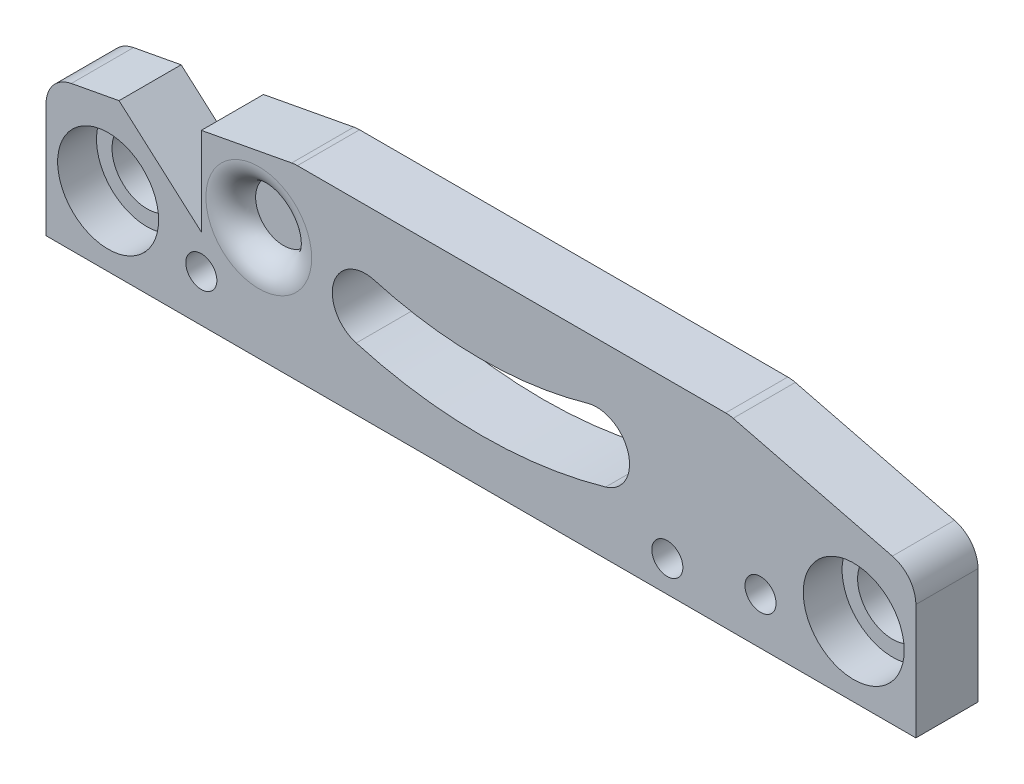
ISO-10303-21;
HEADER;
FILE_DESCRIPTION(('STEP AP214'),'2;1');
FILE_NAME('part.step','',(''),(''),'','','');
FILE_SCHEMA(('AUTOMOTIVE_DESIGN { 1 0 10303 214 1 1 1 1 }'));
ENDSEC;
DATA;
#1=APPLICATION_CONTEXT('core data for automotive mechanical design processes');
#2=APPLICATION_PROTOCOL_DEFINITION('international standard','automotive_design',2000,#1);
#3=PRODUCT_CONTEXT('',#1,'mechanical');
#4=PRODUCT('Part','Part','',(#3));
#5=PRODUCT_RELATED_PRODUCT_CATEGORY('part','',(#4));
#6=PRODUCT_DEFINITION_FORMATION('','',#4);
#7=PRODUCT_DEFINITION_CONTEXT('part definition',#1,'design');
#8=PRODUCT_DEFINITION('design','',#6,#7);
#9=PRODUCT_DEFINITION_SHAPE('','',#8);
#10=(LENGTH_UNIT() NAMED_UNIT(*) SI_UNIT(.MILLI.,.METRE.));
#11=(NAMED_UNIT(*) PLANE_ANGLE_UNIT() SI_UNIT($,.RADIAN.));
#12=(NAMED_UNIT(*) SI_UNIT($,.STERADIAN.) SOLID_ANGLE_UNIT());
#13=UNCERTAINTY_MEASURE_WITH_UNIT(LENGTH_MEASURE(1.E-05),#10,'distance_accuracy_value','');
#14=(GEOMETRIC_REPRESENTATION_CONTEXT(3) GLOBAL_UNCERTAINTY_ASSIGNED_CONTEXT((#13)) GLOBAL_UNIT_ASSIGNED_CONTEXT((#10,
#11,#12)) REPRESENTATION_CONTEXT('',''));
#15=CARTESIAN_POINT('',(0.,0.,0.));
#16=DIRECTION('',(0.,0.,1.));
#17=DIRECTION('',(1.,0.,0.));
#18=AXIS2_PLACEMENT_3D('',#15,#16,#17);
#19=CARTESIAN_POINT('',(-44.45,19.05,0.));
#20=DIRECTION('',(0.,0.,1.));
#21=DIRECTION('',(1.,0.,0.));
#22=AXIS2_PLACEMENT_3D('',#19,#20,#21);
#23=PLANE('',#22);
#24=CARTESIAN_POINT('',(-28.575,4.7625,0.));
#25=DIRECTION('',(0.,0.,1.));
#26=DIRECTION('',(1.,0.,0.));
#27=AXIS2_PLACEMENT_3D('',#24,#25,#26);
#28=CIRCLE('',#27,1.5875);
#29=CARTESIAN_POINT('',(-26.9875,4.7625,0.));
#30=VERTEX_POINT('',#29);
#31=EDGE_CURVE('E512',#30,#30,#28,.T.);
#32=ORIENTED_EDGE('',*,*,#31,.T.);
#33=EDGE_LOOP('',(#32));
#34=FACE_BOUND('',#33,.T.);
#35=CARTESIAN_POINT('',(19.05,3.17500000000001,0.));
#36=DIRECTION('',(0.,0.,1.));
#37=DIRECTION('',(1.,0.,0.));
#38=AXIS2_PLACEMENT_3D('',#35,#36,#37);
#39=CIRCLE('',#38,1.5875);
#40=CARTESIAN_POINT('',(20.6375,3.17500000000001,0.));
#41=VERTEX_POINT('',#40);
#42=EDGE_CURVE('E520',#41,#41,#39,.T.);
#43=ORIENTED_EDGE('',*,*,#42,.T.);
#44=EDGE_LOOP('',(#43));
#45=FACE_BOUND('',#44,.T.);
#46=CARTESIAN_POINT('',(28.575,4.7625,0.));
#47=DIRECTION('',(0.,0.,1.));
#48=DIRECTION('',(1.,0.,0.));
#49=AXIS2_PLACEMENT_3D('',#46,#47,#48);
#50=CIRCLE('',#49,1.5875);
#51=CARTESIAN_POINT('',(30.1625,4.7625,0.));
#52=VERTEX_POINT('',#51);
#53=EDGE_CURVE('E526',#52,#52,#50,.T.);
#54=ORIENTED_EDGE('',*,*,#53,.T.);
#55=EDGE_LOOP('',(#54));
#56=FACE_BOUND('',#55,.T.);
#57=CARTESIAN_POINT('',(-38.1,7.14375,0.));
#58=DIRECTION('',(0.,0.,1.));
#59=DIRECTION('',(1.,0.,0.));
#60=AXIS2_PLACEMENT_3D('',#57,#58,#59);
#61=CIRCLE('',#60,3.57187500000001);
#62=CARTESIAN_POINT('',(-34.528125,7.14375,0.));
#63=VERTEX_POINT('',#62);
#64=EDGE_CURVE('E529',#63,#63,#61,.T.);
#65=ORIENTED_EDGE('',*,*,#64,.T.);
#66=EDGE_LOOP('',(#65));
#67=FACE_BOUND('',#66,.T.);
#68=CARTESIAN_POINT('',(-11.8145061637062,9.59792055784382,0.));
#69=DIRECTION('',(0.,0.,-1.));
#70=DIRECTION('',(-1.,0.,0.));
#71=AXIS2_PLACEMENT_3D('',#68,#69,#70);
#72=CIRCLE('',#71,3.3734375);
#73=CARTESIAN_POINT('',(-12.74435155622,6.35516430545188,0.));
#74=VERTEX_POINT('',#73);
#75=CARTESIAN_POINT('',(-10.8846607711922,12.8406768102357,0.));
#76=VERTEX_POINT('',#75);
#77=EDGE_CURVE('E153',#74,#76,#72,.T.);
#78=ORIENTED_EDGE('',*,*,#77,.F.);
#79=CARTESIAN_POINT('',(0.,50.8,0.));
#80=DIRECTION('',(0.,0.,-1.));
#81=DIRECTION('',(-1.,0.,0.));
#82=AXIS2_PLACEMENT_3D('',#79,#80,#81);
#83=CIRCLE('',#82,46.2359375);
#84=CARTESIAN_POINT('',(12.7443515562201,6.35516430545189,0.));
#85=VERTEX_POINT('',#84);
#86=EDGE_CURVE('E178',#85,#74,#83,.T.);
#87=ORIENTED_EDGE('',*,*,#86,.F.);
#88=CARTESIAN_POINT('',(11.8145061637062,9.59792055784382,0.));
#89=DIRECTION('',(0.,0.,-1.));
#90=DIRECTION('',(-1.,0.,0.));
#91=AXIS2_PLACEMENT_3D('',#88,#89,#90);
#92=CIRCLE('',#91,3.3734375);
#93=CARTESIAN_POINT('',(10.8846607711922,12.8406768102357,0.));
#94=VERTEX_POINT('',#93);
#95=EDGE_CURVE('E176',#94,#85,#92,.T.);
#96=ORIENTED_EDGE('',*,*,#95,.F.);
#97=CARTESIAN_POINT('',(0.,50.8,0.));
#98=DIRECTION('',(0.,0.,1.));
#99=DIRECTION('',(1.,0.,0.));
#100=AXIS2_PLACEMENT_3D('',#97,#98,#99);
#101=CIRCLE('',#100,39.4890625);
#102=EDGE_CURVE('E163',#76,#94,#101,.T.);
#103=ORIENTED_EDGE('',*,*,#102,.F.);
#104=EDGE_LOOP('',(#78,#87,#96,#103));
#105=FACE_BOUND('',#104,.T.);
#106=DIRECTION('',(-0.970142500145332,0.242535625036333,0.));
#107=VECTOR('',#106,1.);
#108=CARTESIAN_POINT('',(44.45,14.2875,0.));
#109=LINE('',#108,#107);
#110=CARTESIAN_POINT('',(42.0450506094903,14.8887373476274,0.));
#111=VERTEX_POINT('',#110);
#112=CARTESIAN_POINT('',(25.7791902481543,18.9552024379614,0.));
#113=VERTEX_POINT('',#112);
#114=EDGE_CURVE('E221',#111,#113,#109,.T.);
#115=ORIENTED_EDGE('',*,*,#114,.F.);
#116=CARTESIAN_POINT('',(41.275,11.808534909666,0.));
#117=DIRECTION('',(0.,0.,1.));
#118=DIRECTION('',(1.,0.,0.));
#119=AXIS2_PLACEMENT_3D('',#116,#117,#118);
#120=CIRCLE('',#119,3.175);
#121=CARTESIAN_POINT('',(44.45,11.808534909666,0.));
#122=VERTEX_POINT('',#121);
#123=EDGE_CURVE('E274',#111,#122,#120,.F.);
#124=ORIENTED_EDGE('',*,*,#123,.T.);
#125=DIRECTION('',(0.,1.,0.));
#126=VECTOR('',#125,1.);
#127=CARTESIAN_POINT('',(44.45,0.,0.));
#128=LINE('',#127,#126);
#129=CARTESIAN_POINT('',(44.45,0.,0.));
#130=VERTEX_POINT('',#129);
#131=EDGE_CURVE('E243',#130,#122,#128,.T.);
#132=ORIENTED_EDGE('',*,*,#131,.F.);
#133=DIRECTION('',(-1.,0.,0.));
#134=VECTOR('',#133,1.);
#135=CARTESIAN_POINT('',(44.45,0.,0.));
#136=LINE('',#135,#134);
#137=CARTESIAN_POINT('',(-44.45,0.,0.));
#138=VERTEX_POINT('',#137);
#139=EDGE_CURVE('E246',#130,#138,#136,.T.);
#140=ORIENTED_EDGE('',*,*,#139,.T.);
#141=DIRECTION('',(0.,1.,0.));
#142=VECTOR('',#141,1.);
#143=CARTESIAN_POINT('',(-44.45,0.,0.));
#144=LINE('',#143,#142);
#145=CARTESIAN_POINT('',(-44.45,11.6524840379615,0.));
#146=VERTEX_POINT('',#145);
#147=EDGE_CURVE('E231',#138,#146,#144,.T.);
#148=ORIENTED_EDGE('',*,*,#147,.T.);
#149=CARTESIAN_POINT('',(-41.275,11.6524840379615,0.));
#150=DIRECTION('',(0.,0.,1.));
#151=DIRECTION('',(1.,0.,0.));
#152=AXIS2_PLACEMENT_3D('',#149,#150,#151);
#153=CIRCLE('',#152,3.175);
#154=CARTESIAN_POINT('',(-41.8601160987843,14.7731032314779,0.));
#155=VERTEX_POINT('',#154);
#156=EDGE_CURVE('E47',#146,#155,#153,.F.);
#157=ORIENTED_EDGE('',*,*,#156,.T.);
#158=DIRECTION('',(-0.982872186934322,-0.184288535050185,0.));
#159=VECTOR('',#158,1.);
#160=CARTESIAN_POINT('',(-43.587358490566,14.4492452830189,0.));
#161=LINE('',#160,#159);
#162=CARTESIAN_POINT('',(-36.9843867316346,15.6873024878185,0.));
#163=VERTEX_POINT('',#162);
#164=EDGE_CURVE('E217',#163,#155,#161,.T.);
#165=ORIENTED_EDGE('',*,*,#164,.F.);
#166=DIRECTION('',(0.749616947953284,-0.661871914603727,0.));
#167=VECTOR('',#166,1.);
#168=CARTESIAN_POINT('',(-36.9843867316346,15.6873024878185,0.));
#169=LINE('',#168,#167);
#170=CARTESIAN_POINT('',(-28.575,8.26226105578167,0.));
#171=VERTEX_POINT('',#170);
#172=EDGE_CURVE('E199',#163,#171,#169,.T.);
#173=ORIENTED_EDGE('',*,*,#172,.T.);
#174=DIRECTION('',(0.,1.,0.));
#175=VECTOR('',#174,1.);
#176=CARTESIAN_POINT('',(-28.575,8.26226105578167,0.));
#177=LINE('',#176,#175);
#178=CARTESIAN_POINT('',(-28.575,17.2640625,0.));
#179=VERTEX_POINT('',#178);
#180=EDGE_CURVE('E196',#171,#179,#177,.T.);
#181=ORIENTED_EDGE('',*,*,#180,.T.);
#182=CARTESIAN_POINT('',(-19.3400309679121,18.9956191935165,0.));
#183=VERTEX_POINT('',#182);
#184=EDGE_CURVE('E218',#183,#179,#161,.T.);
#185=ORIENTED_EDGE('',*,*,#184,.F.);
#186=CARTESIAN_POINT('',(-18.7549148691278,15.875,0.));
#187=DIRECTION('',(0.,0.,1.));
#188=DIRECTION('',(1.,0.,0.));
#189=AXIS2_PLACEMENT_3D('',#186,#187,#188);
#190=CIRCLE('',#189,3.175);
#191=CARTESIAN_POINT('',(-18.7549148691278,19.05,0.));
#192=VERTEX_POINT('',#191);
#193=EDGE_CURVE('E271',#183,#192,#190,.F.);
#194=ORIENTED_EDGE('',*,*,#193,.T.);
#195=DIRECTION('',(1.,0.,0.));
#196=VECTOR('',#195,1.);
#197=CARTESIAN_POINT('',(-44.45,19.05,0.));
#198=LINE('',#197,#196);
#199=CARTESIAN_POINT('',(25.0091396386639,19.05,0.));
#200=VERTEX_POINT('',#199);
#201=EDGE_CURVE('E224',#192,#200,#198,.T.);
#202=ORIENTED_EDGE('',*,*,#201,.T.);
#203=CARTESIAN_POINT('',(25.0091396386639,15.875,0.));
#204=DIRECTION('',(0.,0.,1.));
#205=DIRECTION('',(1.,0.,0.));
#206=AXIS2_PLACEMENT_3D('',#203,#204,#205);
#207=CIRCLE('',#206,3.175);
#208=EDGE_CURVE('E269',#200,#113,#207,.F.);
#209=ORIENTED_EDGE('',*,*,#208,.T.);
#210=EDGE_LOOP('',(#115,#124,#132,#140,#148,#157,#165,#173,#181,#185,#194,#202,#209));
#211=FACE_BOUND('',#210,.T.);
#212=CARTESIAN_POINT('',(38.1,7.14375,0.));
#213=DIRECTION('',(0.,0.,1.));
#214=DIRECTION('',(1.,0.,0.));
#215=AXIS2_PLACEMENT_3D('',#212,#213,#214);
#216=CIRCLE('',#215,3.57187500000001);
#217=CARTESIAN_POINT('',(41.671875,7.14375,0.));
#218=VERTEX_POINT('',#217);
#219=EDGE_CURVE('E543',#218,#218,#216,.T.);
#220=ORIENTED_EDGE('',*,*,#219,.T.);
#221=EDGE_LOOP('',(#220));
#222=FACE_BOUND('',#221,.T.);
#223=ADVANCED_FACE('F32',(#34,#45,#56,#67,#105,#211,#222),#23,.F.);
#224=CARTESIAN_POINT('',(-44.45,19.05,6.35));
#225=DIRECTION('',(0.,0.,1.));
#226=DIRECTION('',(1.,0.,0.));
#227=AXIS2_PLACEMENT_3D('',#224,#225,#226);
#228=PLANE('',#227);
#229=CARTESIAN_POINT('',(-22.7049600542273,11.5847327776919,6.35));
#230=DIRECTION('',(0.,0.,1.));
#231=DIRECTION('',(1.,0.,0.));
#232=AXIS2_PLACEMENT_3D('',#229,#230,#231);
#233=CIRCLE('',#232,5.40317996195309);
#234=CARTESIAN_POINT('',(-17.3017800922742,11.5847327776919,6.35));
#235=VERTEX_POINT('',#234);
#236=EDGE_CURVE('E11',#235,#235,#233,.F.);
#237=ORIENTED_EDGE('',*,*,#236,.T.);
#238=EDGE_LOOP('',(#237));
#239=FACE_BOUND('',#238,.T.);
#240=CARTESIAN_POINT('',(-28.575,4.7625,6.35));
#241=DIRECTION('',(0.,0.,1.));
#242=DIRECTION('',(1.,0.,0.));
#243=AXIS2_PLACEMENT_3D('',#240,#241,#242);
#244=CIRCLE('',#243,1.5875);
#245=CARTESIAN_POINT('',(-26.9875,4.7625,6.35));
#246=VERTEX_POINT('',#245);
#247=EDGE_CURVE('E514',#246,#246,#244,.T.);
#248=ORIENTED_EDGE('',*,*,#247,.F.);
#249=EDGE_LOOP('',(#248));
#250=FACE_BOUND('',#249,.T.);
#251=CARTESIAN_POINT('',(19.05,3.17500000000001,6.34999999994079));
#252=DIRECTION('',(0.,0.,1.));
#253=DIRECTION('',(1.,0.,0.));
#254=AXIS2_PLACEMENT_3D('',#251,#252,#253);
#255=CIRCLE('',#254,1.5875);
#256=CARTESIAN_POINT('',(20.6375,3.17500000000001,6.34999999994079));
#257=VERTEX_POINT('',#256);
#258=EDGE_CURVE('E519',#257,#257,#255,.T.);
#259=ORIENTED_EDGE('',*,*,#258,.F.);
#260=EDGE_LOOP('',(#259));
#261=FACE_BOUND('',#260,.T.);
#262=CARTESIAN_POINT('',(28.575,4.7625,6.35));
#263=DIRECTION('',(0.,0.,1.));
#264=DIRECTION('',(1.,0.,0.));
#265=AXIS2_PLACEMENT_3D('',#262,#263,#264);
#266=CIRCLE('',#265,1.5875);
#267=CARTESIAN_POINT('',(30.1625,4.7625,6.35));
#268=VERTEX_POINT('',#267);
#269=EDGE_CURVE('E523',#268,#268,#266,.T.);
#270=ORIENTED_EDGE('',*,*,#269,.F.);
#271=EDGE_LOOP('',(#270));
#272=FACE_BOUND('',#271,.T.);
#273=CARTESIAN_POINT('',(-38.1,7.14375,6.35));
#274=DIRECTION('',(0.,0.,1.));
#275=DIRECTION('',(1.,0.,0.));
#276=AXIS2_PLACEMENT_3D('',#273,#274,#275);
#277=CIRCLE('',#276,5.15937499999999);
#278=CARTESIAN_POINT('',(-32.940625,7.14375,6.35));
#279=VERTEX_POINT('',#278);
#280=EDGE_CURVE('E540',#279,#279,#277,.T.);
#281=ORIENTED_EDGE('',*,*,#280,.F.);
#282=EDGE_LOOP('',(#281));
#283=FACE_BOUND('',#282,.T.);
#284=CARTESIAN_POINT('',(0.,50.8,6.35));
#285=DIRECTION('',(0.,0.,-1.));
#286=DIRECTION('',(-1.,0.,0.));
#287=AXIS2_PLACEMENT_3D('',#284,#285,#286);
#288=CIRCLE('',#287,46.2359375);
#289=CARTESIAN_POINT('',(12.7443515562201,6.35516430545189,6.35));
#290=VERTEX_POINT('',#289);
#291=CARTESIAN_POINT('',(-12.74435155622,6.35516430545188,6.35));
#292=VERTEX_POINT('',#291);
#293=EDGE_CURVE('E164',#290,#292,#288,.T.);
#294=ORIENTED_EDGE('',*,*,#293,.T.);
#295=CARTESIAN_POINT('',(-11.8145061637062,9.59792055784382,6.35));
#296=DIRECTION('',(0.,0.,-1.));
#297=DIRECTION('',(-1.,0.,0.));
#298=AXIS2_PLACEMENT_3D('',#295,#296,#297);
#299=CIRCLE('',#298,3.3734375);
#300=CARTESIAN_POINT('',(-10.8846607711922,12.8406768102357,6.35));
#301=VERTEX_POINT('',#300);
#302=EDGE_CURVE('E183',#292,#301,#299,.T.);
#303=ORIENTED_EDGE('',*,*,#302,.T.);
#304=CARTESIAN_POINT('',(0.,50.8,6.35));
#305=DIRECTION('',(0.,0.,1.));
#306=DIRECTION('',(1.,0.,0.));
#307=AXIS2_PLACEMENT_3D('',#304,#305,#306);
#308=CIRCLE('',#307,39.4890625);
#309=CARTESIAN_POINT('',(10.8846607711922,12.8406768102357,6.35));
#310=VERTEX_POINT('',#309);
#311=EDGE_CURVE('E170',#301,#310,#308,.T.);
#312=ORIENTED_EDGE('',*,*,#311,.T.);
#313=CARTESIAN_POINT('',(11.8145061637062,9.59792055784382,6.35));
#314=DIRECTION('',(0.,0.,-1.));
#315=DIRECTION('',(-1.,0.,0.));
#316=AXIS2_PLACEMENT_3D('',#313,#314,#315);
#317=CIRCLE('',#316,3.3734375);
#318=EDGE_CURVE('E187',#310,#290,#317,.T.);
#319=ORIENTED_EDGE('',*,*,#318,.T.);
#320=EDGE_LOOP('',(#294,#303,#312,#319));
#321=FACE_BOUND('',#320,.T.);
#322=DIRECTION('',(0.,1.,0.));
#323=VECTOR('',#322,1.);
#324=CARTESIAN_POINT('',(44.45,0.,6.35));
#325=LINE('',#324,#323);
#326=CARTESIAN_POINT('',(44.45,0.,6.35));
#327=VERTEX_POINT('',#326);
#328=CARTESIAN_POINT('',(44.45,11.808534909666,6.35));
#329=VERTEX_POINT('',#328);
#330=EDGE_CURVE('E230',#327,#329,#325,.T.);
#331=ORIENTED_EDGE('',*,*,#330,.T.);
#332=CARTESIAN_POINT('',(41.275,11.808534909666,6.35));
#333=DIRECTION('',(0.,0.,1.));
#334=DIRECTION('',(1.,0.,0.));
#335=AXIS2_PLACEMENT_3D('',#332,#333,#334);
#336=CIRCLE('',#335,3.175);
#337=CARTESIAN_POINT('',(42.0450506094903,14.8887373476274,6.35));
#338=VERTEX_POINT('',#337);
#339=EDGE_CURVE('E262',#329,#338,#336,.T.);
#340=ORIENTED_EDGE('',*,*,#339,.T.);
#341=DIRECTION('',(-0.970142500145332,0.242535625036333,0.));
#342=VECTOR('',#341,1.);
#343=CARTESIAN_POINT('',(44.45,14.2875,6.35));
#344=LINE('',#343,#342);
#345=CARTESIAN_POINT('',(25.7791902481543,18.9552024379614,6.35));
#346=VERTEX_POINT('',#345);
#347=EDGE_CURVE('E220',#338,#346,#344,.T.);
#348=ORIENTED_EDGE('',*,*,#347,.T.);
#349=CARTESIAN_POINT('',(25.0091396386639,15.875,6.35));
#350=DIRECTION('',(0.,0.,1.));
#351=DIRECTION('',(1.,0.,0.));
#352=AXIS2_PLACEMENT_3D('',#349,#350,#351);
#353=CIRCLE('',#352,3.175);
#354=CARTESIAN_POINT('',(25.0091396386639,19.05,6.35));
#355=VERTEX_POINT('',#354);
#356=EDGE_CURVE('E256',#346,#355,#353,.T.);
#357=ORIENTED_EDGE('',*,*,#356,.T.);
#358=DIRECTION('',(1.,0.,0.));
#359=VECTOR('',#358,1.);
#360=CARTESIAN_POINT('',(-44.45,19.05,6.35));
#361=LINE('',#360,#359);
#362=CARTESIAN_POINT('',(-18.7549148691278,19.05,6.35));
#363=VERTEX_POINT('',#362);
#364=EDGE_CURVE('E227',#363,#355,#361,.T.);
#365=ORIENTED_EDGE('',*,*,#364,.F.);
#366=CARTESIAN_POINT('',(-18.7549148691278,15.875,6.35));
#367=DIRECTION('',(0.,0.,1.));
#368=DIRECTION('',(1.,0.,0.));
#369=AXIS2_PLACEMENT_3D('',#366,#367,#368);
#370=CIRCLE('',#369,3.175);
#371=CARTESIAN_POINT('',(-19.3400309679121,18.9956191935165,6.35));
#372=VERTEX_POINT('',#371);
#373=EDGE_CURVE('E258',#363,#372,#370,.T.);
#374=ORIENTED_EDGE('',*,*,#373,.T.);
#375=DIRECTION('',(0.982872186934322,0.184288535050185,0.));
#376=VECTOR('',#375,1.);
#377=CARTESIAN_POINT('',(-44.45,14.2875,6.35));
#378=LINE('',#377,#376);
#379=CARTESIAN_POINT('',(-28.575,17.2640625,6.35));
#380=VERTEX_POINT('',#379);
#381=EDGE_CURVE('E214',#380,#372,#378,.T.);
#382=ORIENTED_EDGE('',*,*,#381,.F.);
#383=DIRECTION('',(0.,1.,0.));
#384=VECTOR('',#383,1.);
#385=CARTESIAN_POINT('',(-28.575,8.26226105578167,6.35));
#386=LINE('',#385,#384);
#387=CARTESIAN_POINT('',(-28.575,8.26226105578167,6.35));
#388=VERTEX_POINT('',#387);
#389=EDGE_CURVE('E171',#388,#380,#386,.T.);
#390=ORIENTED_EDGE('',*,*,#389,.F.);
#391=DIRECTION('',(0.749616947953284,-0.661871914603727,0.));
#392=VECTOR('',#391,1.);
#393=CARTESIAN_POINT('',(-36.9843867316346,15.6873024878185,6.35));
#394=LINE('',#393,#392);
#395=CARTESIAN_POINT('',(-36.9843867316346,15.6873024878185,6.35));
#396=VERTEX_POINT('',#395);
#397=EDGE_CURVE('E200',#396,#388,#394,.T.);
#398=ORIENTED_EDGE('',*,*,#397,.F.);
#399=CARTESIAN_POINT('',(-41.8601160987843,14.7731032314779,6.35));
#400=VERTEX_POINT('',#399);
#401=EDGE_CURVE('E215',#400,#396,#378,.T.);
#402=ORIENTED_EDGE('',*,*,#401,.F.);
#403=CARTESIAN_POINT('',(-41.275,11.6524840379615,6.35));
#404=DIRECTION('',(0.,0.,1.));
#405=DIRECTION('',(1.,0.,0.));
#406=AXIS2_PLACEMENT_3D('',#403,#404,#405);
#407=CIRCLE('',#406,3.175);
#408=CARTESIAN_POINT('',(-44.45,11.6524840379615,6.35));
#409=VERTEX_POINT('',#408);
#410=EDGE_CURVE('E260',#400,#409,#407,.T.);
#411=ORIENTED_EDGE('',*,*,#410,.T.);
#412=DIRECTION('',(0.,1.,0.));
#413=VECTOR('',#412,1.);
#414=CARTESIAN_POINT('',(-44.45,0.,6.35));
#415=LINE('',#414,#413);
#416=CARTESIAN_POINT('',(-44.45,0.,6.35));
#417=VERTEX_POINT('',#416);
#418=EDGE_CURVE('E237',#417,#409,#415,.T.);
#419=ORIENTED_EDGE('',*,*,#418,.F.);
#420=DIRECTION('',(-1.,0.,0.));
#421=VECTOR('',#420,1.);
#422=CARTESIAN_POINT('',(44.45,0.,6.35));
#423=LINE('',#422,#421);
#424=EDGE_CURVE('E234',#327,#417,#423,.T.);
#425=ORIENTED_EDGE('',*,*,#424,.F.);
#426=EDGE_LOOP('',(#331,#340,#348,#357,#365,#374,#382,#390,#398,#402,#411,#419,#425));
#427=FACE_BOUND('',#426,.T.);
#428=CARTESIAN_POINT('',(38.1,7.14375,6.35));
#429=DIRECTION('',(0.,0.,1.));
#430=DIRECTION('',(1.,0.,0.));
#431=AXIS2_PLACEMENT_3D('',#428,#429,#430);
#432=CIRCLE('',#431,5.15937499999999);
#433=CARTESIAN_POINT('',(43.259375,7.14375,6.35));
#434=VERTEX_POINT('',#433);
#435=EDGE_CURVE('E185',#434,#434,#432,.T.);
#436=ORIENTED_EDGE('',*,*,#435,.F.);
#437=EDGE_LOOP('',(#436));
#438=FACE_BOUND('',#437,.T.);
#439=ADVANCED_FACE('F293',(#239,#250,#261,#272,#283,#321,#427,#438),#228,.T.);
#440=CARTESIAN_POINT('',(-44.45,14.2875,6.35));
#441=DIRECTION('',(-0.184288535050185,0.982872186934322,0.));
#442=DIRECTION('',(-0.982872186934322,-0.184288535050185,0.));
#443=AXIS2_PLACEMENT_3D('',#440,#441,#442);
#444=PLANE('',#443);
#445=ORIENTED_EDGE('',*,*,#381,.T.);
#446=DIRECTION('',(0.,0.,-1.));
#447=VECTOR('',#446,1.);
#448=CARTESIAN_POINT('',(-19.3400309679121,18.9956191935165,6.35));
#449=LINE('',#448,#447);
#450=EDGE_CURVE('E280',#372,#183,#449,.T.);
#451=ORIENTED_EDGE('',*,*,#450,.T.);
#452=ORIENTED_EDGE('',*,*,#184,.T.);
#453=DIRECTION('',(0.,0.,1.));
#454=VECTOR('',#453,1.);
#455=CARTESIAN_POINT('',(-28.575,17.2640625,0.));
#456=LINE('',#455,#454);
#457=EDGE_CURVE('E211',#179,#380,#456,.T.);
#458=ORIENTED_EDGE('',*,*,#457,.T.);
#459=EDGE_LOOP('',(#445,#451,#452,#458));
#460=FACE_BOUND('',#459,.T.);
#461=ADVANCED_FACE('F301',(#460),#444,.T.);
#462=CARTESIAN_POINT('',(-44.45,19.05,6.35));
#463=DIRECTION('',(0.,1.,0.));
#464=DIRECTION('',(-1.,0.,0.));
#465=AXIS2_PLACEMENT_3D('',#462,#463,#464);
#466=PLANE('',#465);
#467=ORIENTED_EDGE('',*,*,#201,.F.);
#468=DIRECTION('',(0.,0.,-1.));
#469=VECTOR('',#468,1.);
#470=CARTESIAN_POINT('',(-18.7549148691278,19.05,6.35));
#471=LINE('',#470,#469);
#472=EDGE_CURVE('E40',#192,#363,#471,.F.);
#473=ORIENTED_EDGE('',*,*,#472,.T.);
#474=ORIENTED_EDGE('',*,*,#364,.T.);
#475=DIRECTION('',(0.,0.,1.));
#476=VECTOR('',#475,1.);
#477=CARTESIAN_POINT('',(25.0091396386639,19.05,6.35));
#478=LINE('',#477,#476);
#479=EDGE_CURVE('E283',#355,#200,#478,.F.);
#480=ORIENTED_EDGE('',*,*,#479,.T.);
#481=EDGE_LOOP('',(#467,#473,#474,#480));
#482=FACE_BOUND('',#481,.T.);
#483=ADVANCED_FACE('F288',(#482),#466,.T.);
#484=CARTESIAN_POINT('',(-44.45,0.,6.35));
#485=DIRECTION('',(-1.,0.,0.));
#486=DIRECTION('',(0.,-1.,0.));
#487=AXIS2_PLACEMENT_3D('',#484,#485,#486);
#488=PLANE('',#487);
#489=ORIENTED_EDGE('',*,*,#418,.T.);
#490=DIRECTION('',(0.,0.,-1.));
#491=VECTOR('',#490,1.);
#492=CARTESIAN_POINT('',(-44.45,11.6524840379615,6.35));
#493=LINE('',#492,#491);
#494=EDGE_CURVE('E276',#409,#146,#493,.T.);
#495=ORIENTED_EDGE('',*,*,#494,.T.);
#496=ORIENTED_EDGE('',*,*,#147,.F.);
#497=DIRECTION('',(0.,0.,-1.));
#498=VECTOR('',#497,1.);
#499=CARTESIAN_POINT('',(-44.45,0.,6.35));
#500=LINE('',#499,#498);
#501=EDGE_CURVE('E250',#417,#138,#500,.T.);
#502=ORIENTED_EDGE('',*,*,#501,.F.);
#503=EDGE_LOOP('',(#489,#495,#496,#502));
#504=FACE_BOUND('',#503,.T.);
#505=ADVANCED_FACE('F321',(#504),#488,.T.);
#506=CARTESIAN_POINT('',(44.45,0.,6.35));
#507=DIRECTION('',(-1.,0.,0.));
#508=DIRECTION('',(0.,-1.,0.));
#509=AXIS2_PLACEMENT_3D('',#506,#507,#508);
#510=PLANE('',#509);
#511=ORIENTED_EDGE('',*,*,#131,.T.);
#512=DIRECTION('',(0.,0.,1.));
#513=VECTOR('',#512,1.);
#514=CARTESIAN_POINT('',(44.45,11.808534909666,6.35));
#515=LINE('',#514,#513);
#516=EDGE_CURVE('E252',#122,#329,#515,.T.);
#517=ORIENTED_EDGE('',*,*,#516,.T.);
#518=ORIENTED_EDGE('',*,*,#330,.F.);
#519=DIRECTION('',(0.,0.,-1.));
#520=VECTOR('',#519,1.);
#521=CARTESIAN_POINT('',(44.45,0.,6.35));
#522=LINE('',#521,#520);
#523=EDGE_CURVE('E240',#327,#130,#522,.T.);
#524=ORIENTED_EDGE('',*,*,#523,.T.);
#525=EDGE_LOOP('',(#511,#517,#518,#524));
#526=FACE_BOUND('',#525,.T.);
#527=ADVANCED_FACE('F329',(#526),#510,.F.);
#528=CARTESIAN_POINT('',(44.45,0.,6.35));
#529=DIRECTION('',(0.,-1.,0.));
#530=DIRECTION('',(1.,0.,0.));
#531=AXIS2_PLACEMENT_3D('',#528,#529,#530);
#532=PLANE('',#531);
#533=ORIENTED_EDGE('',*,*,#139,.F.);
#534=ORIENTED_EDGE('',*,*,#523,.F.);
#535=ORIENTED_EDGE('',*,*,#424,.T.);
#536=ORIENTED_EDGE('',*,*,#501,.T.);
#537=EDGE_LOOP('',(#533,#534,#535,#536));
#538=FACE_BOUND('',#537,.T.);
#539=ADVANCED_FACE('F325',(#538),#532,.T.);
#540=CARTESIAN_POINT('',(44.45,14.2875,0.));
#541=DIRECTION('',(0.242535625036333,0.970142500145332,0.));
#542=DIRECTION('',(-0.970142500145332,0.242535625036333,0.));
#543=AXIS2_PLACEMENT_3D('',#540,#541,#542);
#544=PLANE('',#543);
#545=ORIENTED_EDGE('',*,*,#347,.F.);
#546=DIRECTION('',(0.,0.,1.));
#547=VECTOR('',#546,1.);
#548=CARTESIAN_POINT('',(42.0450506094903,14.8887373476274,0.));
#549=LINE('',#548,#547);
#550=EDGE_CURVE('E267',#338,#111,#549,.F.);
#551=ORIENTED_EDGE('',*,*,#550,.T.);
#552=ORIENTED_EDGE('',*,*,#114,.T.);
#553=DIRECTION('',(0.,0.,1.));
#554=VECTOR('',#553,1.);
#555=CARTESIAN_POINT('',(25.7791902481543,18.9552024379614,0.));
#556=LINE('',#555,#554);
#557=EDGE_CURVE('E264',#113,#346,#556,.T.);
#558=ORIENTED_EDGE('',*,*,#557,.T.);
#559=EDGE_LOOP('',(#545,#551,#552,#558));
#560=FACE_BOUND('',#559,.T.);
#561=ADVANCED_FACE('F337',(#560),#544,.T.);
#562=ORIENTED_EDGE('',*,*,#164,.T.);
#563=DIRECTION('',(0.,0.,-1.));
#564=VECTOR('',#563,1.);
#565=CARTESIAN_POINT('',(-41.8601160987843,14.7731032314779,6.35));
#566=LINE('',#565,#564);
#567=EDGE_CURVE('E278',#155,#400,#566,.F.);
#568=ORIENTED_EDGE('',*,*,#567,.T.);
#569=ORIENTED_EDGE('',*,*,#401,.T.);
#570=DIRECTION('',(0.,0.,1.));
#571=VECTOR('',#570,1.);
#572=CARTESIAN_POINT('',(-36.9843867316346,15.6873024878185,0.));
#573=LINE('',#572,#571);
#574=EDGE_CURVE('E203',#163,#396,#573,.T.);
#575=ORIENTED_EDGE('',*,*,#574,.F.);
#576=EDGE_LOOP('',(#562,#568,#569,#575));
#577=FACE_BOUND('',#576,.T.);
#578=ADVANCED_FACE('F316',(#577),#444,.T.);
#579=CARTESIAN_POINT('',(-28.575,8.26226105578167,0.));
#580=DIRECTION('',(1.,0.,0.));
#581=DIRECTION('',(0.,0.,-1.));
#582=AXIS2_PLACEMENT_3D('',#579,#580,#581);
#583=PLANE('',#582);
#584=ORIENTED_EDGE('',*,*,#389,.T.);
#585=ORIENTED_EDGE('',*,*,#457,.F.);
#586=ORIENTED_EDGE('',*,*,#180,.F.);
#587=DIRECTION('',(0.,0.,1.));
#588=VECTOR('',#587,1.);
#589=CARTESIAN_POINT('',(-28.575,8.26226105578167,0.));
#590=LINE('',#589,#588);
#591=EDGE_CURVE('E209',#171,#388,#590,.T.);
#592=ORIENTED_EDGE('',*,*,#591,.T.);
#593=EDGE_LOOP('',(#584,#585,#586,#592));
#594=FACE_BOUND('',#593,.T.);
#595=ADVANCED_FACE('F307',(#594),#583,.F.);
#596=CARTESIAN_POINT('',(-36.9843867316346,15.6873024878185,0.));
#597=DIRECTION('',(-0.661871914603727,-0.749616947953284,0.));
#598=DIRECTION('',(0.749616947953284,-0.661871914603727,0.));
#599=AXIS2_PLACEMENT_3D('',#596,#597,#598);
#600=PLANE('',#599);
#601=ORIENTED_EDGE('',*,*,#397,.T.);
#602=ORIENTED_EDGE('',*,*,#591,.F.);
#603=ORIENTED_EDGE('',*,*,#172,.F.);
#604=ORIENTED_EDGE('',*,*,#574,.T.);
#605=EDGE_LOOP('',(#601,#602,#603,#604));
#606=FACE_BOUND('',#605,.T.);
#607=ADVANCED_FACE('F313',(#606),#600,.F.);
#608=CARTESIAN_POINT('',(-11.8145061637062,9.59792055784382,0.));
#609=DIRECTION('',(0.,0.,1.));
#610=DIRECTION('',(1.,0.,0.));
#611=AXIS2_PLACEMENT_3D('',#608,#609,#610);
#612=CYLINDRICAL_SURFACE('',#611,3.3734375);
#613=ORIENTED_EDGE('',*,*,#302,.F.);
#614=DIRECTION('',(0.,0.,1.));
#615=VECTOR('',#614,1.);
#616=CARTESIAN_POINT('',(-12.74435155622,6.35516430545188,0.));
#617=LINE('',#616,#615);
#618=EDGE_CURVE('E159',#74,#292,#617,.T.);
#619=ORIENTED_EDGE('',*,*,#618,.F.);
#620=ORIENTED_EDGE('',*,*,#77,.T.);
#621=DIRECTION('',(0.,0.,1.));
#622=VECTOR('',#621,1.);
#623=CARTESIAN_POINT('',(-10.8846607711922,12.8406768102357,0.));
#624=LINE('',#623,#622);
#625=EDGE_CURVE('E156',#76,#301,#624,.T.);
#626=ORIENTED_EDGE('',*,*,#625,.T.);
#627=EDGE_LOOP('',(#613,#619,#620,#626));
#628=FACE_BOUND('',#627,.T.);
#629=ADVANCED_FACE('F155',(#628),#612,.F.);
#630=CARTESIAN_POINT('',(0.,50.8,0.));
#631=DIRECTION('',(0.,0.,1.));
#632=DIRECTION('',(1.,0.,0.));
#633=AXIS2_PLACEMENT_3D('',#630,#631,#632);
#634=CYLINDRICAL_SURFACE('',#633,39.4890625);
#635=ORIENTED_EDGE('',*,*,#311,.F.);
#636=ORIENTED_EDGE('',*,*,#625,.F.);
#637=ORIENTED_EDGE('',*,*,#102,.T.);
#638=DIRECTION('',(0.,0.,1.));
#639=VECTOR('',#638,1.);
#640=CARTESIAN_POINT('',(10.8846607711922,12.8406768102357,0.));
#641=LINE('',#640,#639);
#642=EDGE_CURVE('E172',#94,#310,#641,.T.);
#643=ORIENTED_EDGE('',*,*,#642,.T.);
#644=EDGE_LOOP('',(#635,#636,#637,#643));
#645=FACE_BOUND('',#644,.T.);
#646=ADVANCED_FACE('F167',(#645),#634,.T.);
#647=CARTESIAN_POINT('',(11.8145061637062,9.59792055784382,0.));
#648=DIRECTION('',(0.,0.,1.));
#649=DIRECTION('',(1.,0.,0.));
#650=AXIS2_PLACEMENT_3D('',#647,#648,#649);
#651=CYLINDRICAL_SURFACE('',#650,3.3734375);
#652=ORIENTED_EDGE('',*,*,#318,.F.);
#653=ORIENTED_EDGE('',*,*,#642,.F.);
#654=ORIENTED_EDGE('',*,*,#95,.T.);
#655=DIRECTION('',(0.,0.,1.));
#656=VECTOR('',#655,1.);
#657=CARTESIAN_POINT('',(12.7443515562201,6.35516430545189,0.));
#658=LINE('',#657,#656);
#659=EDGE_CURVE('E193',#85,#290,#658,.T.);
#660=ORIENTED_EDGE('',*,*,#659,.T.);
#661=EDGE_LOOP('',(#652,#653,#654,#660));
#662=FACE_BOUND('',#661,.T.);
#663=ADVANCED_FACE('F567',(#662),#651,.F.);
#664=CARTESIAN_POINT('',(0.,50.8,0.));
#665=DIRECTION('',(0.,0.,1.));
#666=DIRECTION('',(1.,0.,0.));
#667=AXIS2_PLACEMENT_3D('',#664,#665,#666);
#668=CYLINDRICAL_SURFACE('',#667,46.2359375);
#669=ORIENTED_EDGE('',*,*,#293,.F.);
#670=ORIENTED_EDGE('',*,*,#659,.F.);
#671=ORIENTED_EDGE('',*,*,#86,.T.);
#672=ORIENTED_EDGE('',*,*,#618,.T.);
#673=EDGE_LOOP('',(#669,#670,#671,#672));
#674=FACE_BOUND('',#673,.T.);
#675=ADVANCED_FACE('F374',(#674),#668,.F.);
#676=CARTESIAN_POINT('',(41.275,11.808534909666,6.35));
#677=DIRECTION('',(0.,0.,-1.));
#678=DIRECTION('',(-1.,0.,0.));
#679=AXIS2_PLACEMENT_3D('',#676,#677,#678);
#680=CYLINDRICAL_SURFACE('',#679,3.175);
#681=ORIENTED_EDGE('',*,*,#123,.F.);
#682=ORIENTED_EDGE('',*,*,#550,.F.);
#683=ORIENTED_EDGE('',*,*,#339,.F.);
#684=ORIENTED_EDGE('',*,*,#516,.F.);
#685=EDGE_LOOP('',(#681,#682,#683,#684));
#686=FACE_BOUND('',#685,.T.);
#687=ADVANCED_FACE('F334',(#686),#680,.T.);
#688=CARTESIAN_POINT('',(-41.275,11.6524840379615,6.35));
#689=DIRECTION('',(0.,0.,-1.));
#690=DIRECTION('',(-1.,0.,0.));
#691=AXIS2_PLACEMENT_3D('',#688,#689,#690);
#692=CYLINDRICAL_SURFACE('',#691,3.175);
#693=ORIENTED_EDGE('',*,*,#410,.F.);
#694=ORIENTED_EDGE('',*,*,#567,.F.);
#695=ORIENTED_EDGE('',*,*,#156,.F.);
#696=ORIENTED_EDGE('',*,*,#494,.F.);
#697=EDGE_LOOP('',(#693,#694,#695,#696));
#698=FACE_BOUND('',#697,.T.);
#699=ADVANCED_FACE('F317',(#698),#692,.T.);
#700=CARTESIAN_POINT('',(-18.7549148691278,15.875,6.35));
#701=DIRECTION('',(0.,0.,-1.));
#702=DIRECTION('',(-1.,0.,0.));
#703=AXIS2_PLACEMENT_3D('',#700,#701,#702);
#704=CYLINDRICAL_SURFACE('',#703,3.175);
#705=ORIENTED_EDGE('',*,*,#373,.F.);
#706=ORIENTED_EDGE('',*,*,#472,.F.);
#707=ORIENTED_EDGE('',*,*,#193,.F.);
#708=ORIENTED_EDGE('',*,*,#450,.F.);
#709=EDGE_LOOP('',(#705,#706,#707,#708));
#710=FACE_BOUND('',#709,.T.);
#711=ADVANCED_FACE('F298',(#710),#704,.T.);
#712=CARTESIAN_POINT('',(25.0091396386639,15.875,0.));
#713=DIRECTION('',(0.,0.,1.));
#714=DIRECTION('',(1.,0.,0.));
#715=AXIS2_PLACEMENT_3D('',#712,#713,#714);
#716=CYLINDRICAL_SURFACE('',#715,3.175);
#717=ORIENTED_EDGE('',*,*,#208,.F.);
#718=ORIENTED_EDGE('',*,*,#479,.F.);
#719=ORIENTED_EDGE('',*,*,#356,.F.);
#720=ORIENTED_EDGE('',*,*,#557,.F.);
#721=EDGE_LOOP('',(#717,#718,#719,#720));
#722=FACE_BOUND('',#721,.T.);
#723=ADVANCED_FACE('F341',(#722),#716,.T.);
#724=CARTESIAN_POINT('',(38.1,7.14375,6.35));
#725=DIRECTION('',(0.,0.,1.));
#726=DIRECTION('',(1.,0.,0.));
#727=AXIS2_PLACEMENT_3D('',#724,#725,#726);
#728=CYLINDRICAL_SURFACE('',#727,5.15937499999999);
#729=ORIENTED_EDGE('',*,*,#435,.T.);
#730=EDGE_LOOP('',(#729));
#731=FACE_BOUND('',#730,.T.);
#732=CARTESIAN_POINT('',(38.1,7.14375,2.38125));
#733=DIRECTION('',(0.,0.,1.));
#734=DIRECTION('',(1.,0.,0.));
#735=AXIS2_PLACEMENT_3D('',#732,#733,#734);
#736=CIRCLE('',#735,5.15937499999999);
#737=CARTESIAN_POINT('',(43.259375,7.14375,2.38125));
#738=VERTEX_POINT('',#737);
#739=EDGE_CURVE('E549',#738,#738,#736,.T.);
#740=ORIENTED_EDGE('',*,*,#739,.F.);
#741=EDGE_LOOP('',(#740));
#742=FACE_BOUND('',#741,.T.);
#743=ADVANCED_FACE('F343',(#731,#742),#728,.F.);
#744=CARTESIAN_POINT('',(41.671875,7.14375,2.38125));
#745=DIRECTION('',(0.,0.,1.));
#746=DIRECTION('',(1.,0.,0.));
#747=AXIS2_PLACEMENT_3D('',#744,#745,#746);
#748=PLANE('',#747);
#749=ORIENTED_EDGE('',*,*,#739,.T.);
#750=EDGE_LOOP('',(#749));
#751=FACE_BOUND('',#750,.T.);
#752=CARTESIAN_POINT('',(38.1,7.14375,2.38125));
#753=DIRECTION('',(0.,0.,1.));
#754=DIRECTION('',(1.,0.,0.));
#755=AXIS2_PLACEMENT_3D('',#752,#753,#754);
#756=CIRCLE('',#755,3.57187499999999);
#757=CARTESIAN_POINT('',(41.671875,7.14375,2.38125));
#758=VERTEX_POINT('',#757);
#759=EDGE_CURVE('E546',#758,#758,#756,.T.);
#760=ORIENTED_EDGE('',*,*,#759,.F.);
#761=EDGE_LOOP('',(#760));
#762=FACE_BOUND('',#761,.T.);
#763=ADVANCED_FACE('F348',(#751,#762),#748,.T.);
#764=CARTESIAN_POINT('',(38.1,7.14375,6.35));
#765=DIRECTION('',(0.,0.,1.));
#766=DIRECTION('',(1.,0.,0.));
#767=AXIS2_PLACEMENT_3D('',#764,#765,#766);
#768=CYLINDRICAL_SURFACE('',#767,3.571875);
#769=ORIENTED_EDGE('',*,*,#759,.T.);
#770=EDGE_LOOP('',(#769));
#771=FACE_BOUND('',#770,.T.);
#772=ORIENTED_EDGE('',*,*,#219,.F.);
#773=EDGE_LOOP('',(#772));
#774=FACE_BOUND('',#773,.T.);
#775=ADVANCED_FACE('F406',(#771,#774),#768,.F.);
#776=CARTESIAN_POINT('',(-38.1,7.14375,6.35));
#777=DIRECTION('',(0.,0.,1.));
#778=DIRECTION('',(1.,0.,0.));
#779=AXIS2_PLACEMENT_3D('',#776,#777,#778);
#780=CYLINDRICAL_SURFACE('',#779,5.15937499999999);
#781=ORIENTED_EDGE('',*,*,#280,.T.);
#782=EDGE_LOOP('',(#781));
#783=FACE_BOUND('',#782,.T.);
#784=CARTESIAN_POINT('',(-38.1,7.14375,2.38125));
#785=DIRECTION('',(0.,0.,1.));
#786=DIRECTION('',(1.,0.,0.));
#787=AXIS2_PLACEMENT_3D('',#784,#785,#786);
#788=CIRCLE('',#787,5.15937499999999);
#789=CARTESIAN_POINT('',(-32.940625,7.14375,2.38125));
#790=VERTEX_POINT('',#789);
#791=EDGE_CURVE('E537',#790,#790,#788,.T.);
#792=ORIENTED_EDGE('',*,*,#791,.F.);
#793=EDGE_LOOP('',(#792));
#794=FACE_BOUND('',#793,.T.);
#795=ADVANCED_FACE('F416',(#783,#794),#780,.F.);
#796=CARTESIAN_POINT('',(-34.528125,7.14375,2.38125));
#797=DIRECTION('',(0.,0.,1.));
#798=DIRECTION('',(1.,0.,0.));
#799=AXIS2_PLACEMENT_3D('',#796,#797,#798);
#800=PLANE('',#799);
#801=ORIENTED_EDGE('',*,*,#791,.T.);
#802=EDGE_LOOP('',(#801));
#803=FACE_BOUND('',#802,.T.);
#804=CARTESIAN_POINT('',(-38.1,7.14375,2.38125));
#805=DIRECTION('',(0.,0.,1.));
#806=DIRECTION('',(1.,0.,0.));
#807=AXIS2_PLACEMENT_3D('',#804,#805,#806);
#808=CIRCLE('',#807,3.57187499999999);
#809=CARTESIAN_POINT('',(-34.528125,7.14375,2.38125));
#810=VERTEX_POINT('',#809);
#811=EDGE_CURVE('E534',#810,#810,#808,.T.);
#812=ORIENTED_EDGE('',*,*,#811,.F.);
#813=EDGE_LOOP('',(#812));
#814=FACE_BOUND('',#813,.T.);
#815=ADVANCED_FACE('F426',(#803,#814),#800,.T.);
#816=CARTESIAN_POINT('',(-38.1,7.14375,6.35));
#817=DIRECTION('',(0.,0.,1.));
#818=DIRECTION('',(1.,0.,0.));
#819=AXIS2_PLACEMENT_3D('',#816,#817,#818);
#820=CYLINDRICAL_SURFACE('',#819,3.571875);
#821=ORIENTED_EDGE('',*,*,#811,.T.);
#822=EDGE_LOOP('',(#821));
#823=FACE_BOUND('',#822,.T.);
#824=ORIENTED_EDGE('',*,*,#64,.F.);
#825=EDGE_LOOP('',(#824));
#826=FACE_BOUND('',#825,.T.);
#827=ADVANCED_FACE('F436',(#823,#826),#820,.F.);
#828=CARTESIAN_POINT('',(28.575,4.7625,0.));
#829=DIRECTION('',(0.,0.,1.));
#830=DIRECTION('',(1.,0.,0.));
#831=AXIS2_PLACEMENT_3D('',#828,#829,#830);
#832=CYLINDRICAL_SURFACE('',#831,1.5875);
#833=ORIENTED_EDGE('',*,*,#53,.F.);
#834=EDGE_LOOP('',(#833));
#835=FACE_BOUND('',#834,.T.);
#836=ORIENTED_EDGE('',*,*,#269,.T.);
#837=EDGE_LOOP('',(#836));
#838=FACE_BOUND('',#837,.T.);
#839=ADVANCED_FACE('F446',(#835,#838),#832,.F.);
#840=CARTESIAN_POINT('',(19.05,3.17500000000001,0.));
#841=DIRECTION('',(0.,0.,1.));
#842=DIRECTION('',(1.,0.,0.));
#843=AXIS2_PLACEMENT_3D('',#840,#841,#842);
#844=CYLINDRICAL_SURFACE('',#843,1.5875);
#845=ORIENTED_EDGE('',*,*,#42,.F.);
#846=EDGE_LOOP('',(#845));
#847=FACE_BOUND('',#846,.T.);
#848=ORIENTED_EDGE('',*,*,#258,.T.);
#849=EDGE_LOOP('',(#848));
#850=FACE_BOUND('',#849,.T.);
#851=ADVANCED_FACE('F456',(#847,#850),#844,.F.);
#852=CARTESIAN_POINT('',(-28.575,4.7625,0.));
#853=DIRECTION('',(0.,0.,1.));
#854=DIRECTION('',(1.,0.,0.));
#855=AXIS2_PLACEMENT_3D('',#852,#853,#854);
#856=CYLINDRICAL_SURFACE('',#855,1.5875);
#857=ORIENTED_EDGE('',*,*,#31,.F.);
#858=EDGE_LOOP('',(#857));
#859=FACE_BOUND('',#858,.T.);
#860=ORIENTED_EDGE('',*,*,#247,.T.);
#861=EDGE_LOOP('',(#860));
#862=FACE_BOUND('',#861,.T.);
#863=ADVANCED_FACE('F465',(#859,#862),#856,.F.);
#864=CARTESIAN_POINT('',(-22.7049600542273,11.5847327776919,3.81));
#865=DIRECTION('',(0.,0.,1.));
#866=DIRECTION('',(1.,0.,0.));
#867=AXIS2_PLACEMENT_3D('',#864,#865,#866);
#868=PLANE('',#867);
#869=CARTESIAN_POINT('',(-22.7049600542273,11.5847327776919,3.81));
#870=DIRECTION('',(0.,0.,1.));
#871=DIRECTION('',(1.,0.,0.));
#872=AXIS2_PLACEMENT_3D('',#869,#870,#871);
#873=CIRCLE('',#872,2.86317996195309);
#874=CARTESIAN_POINT('',(-19.8417800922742,11.5847327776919,3.81));
#875=VERTEX_POINT('',#874);
#876=EDGE_CURVE('E511',#875,#875,#873,.T.);
#877=ORIENTED_EDGE('',*,*,#876,.T.);
#878=EDGE_LOOP('',(#877));
#879=FACE_BOUND('',#878,.T.);
#880=ADVANCED_FACE('F479',(#879),#868,.T.);
#881=CARTESIAN_POINT('',(-22.7049600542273,11.5847327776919,3.81));
#882=DIRECTION('',(0.,0.,1.));
#883=DIRECTION('',(1.,0.,0.));
#884=AXIS2_PLACEMENT_3D('',#881,#882,#883);
#885=TOROIDAL_SURFACE('',#884,5.40317996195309,2.54);
#886=ORIENTED_EDGE('',*,*,#236,.F.);
#887=EDGE_LOOP('',(#886));
#888=FACE_BOUND('',#887,.T.);
#889=ORIENTED_EDGE('',*,*,#876,.F.);
#890=EDGE_LOOP('',(#889));
#891=FACE_BOUND('',#890,.T.);
#892=ADVANCED_FACE('F34',(#888,#891),#885,.T.);
#893=CLOSED_SHELL('',(#223,#439,#461,#483,#505,#527,#539,#561,#578,#595,#607,#629,#646,#663,
#675,#687,#699,#711,#723,#743,#763,#775,#795,#815,#827,#839,#851,#863,#880,#892));
#894=MANIFOLD_SOLID_BREP('B2',#893);
#895=ADVANCED_BREP_SHAPE_REPRESENTATION('',(#18,#894),#14);
#896=SHAPE_DEFINITION_REPRESENTATION(#9,#895);
ENDSEC;
END-ISO-10303-21;
